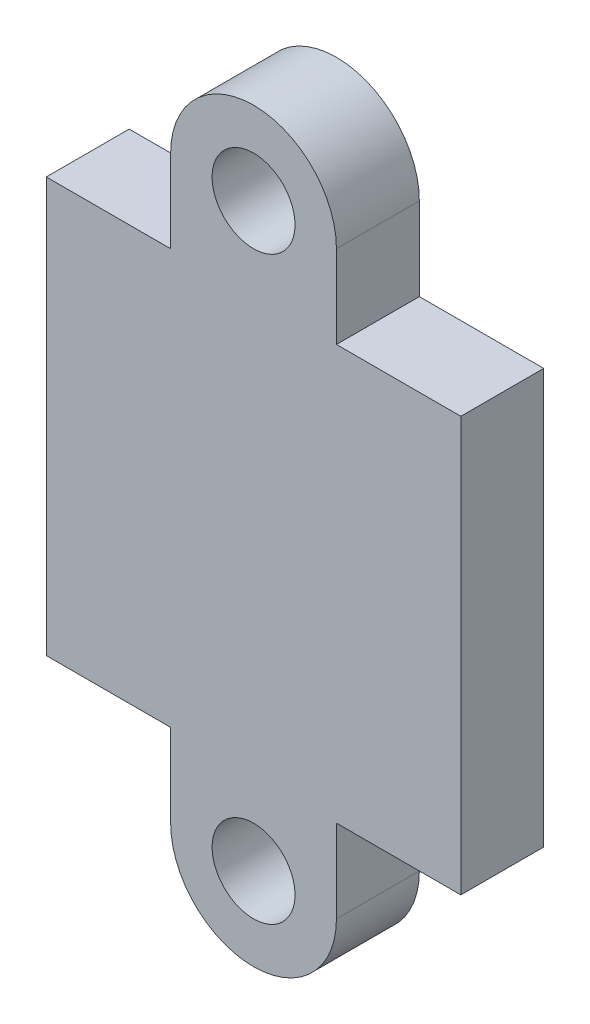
from build123d import *

# Parameters (mm, degrees)
SKETCH1_R      = 10
EXTRUDE1_DEPTH = 10


with BuildPart() as part:
    # Sketch1 → Extrude1 (new, symmetric)
    with BuildSketch(Plane.XY):
        with BuildLine():
            Line((0, -50), (0, 50))
            Line((0, 50), (30, 50))
            Line((30, 50), (30, 70))
            ThreePointArc((30, 70), (50, 90), (70, 70))
            Line((70, 70), (70, 50))
            Line((70, 50), (100, 50))
            Line((100, 50), (100, -50))
            Line((100, -50), (70, -50))
            Line((70, -50), (70, -70))
            ThreePointArc((70, -70), (50, -90), (30, -70))
            Line((30, -70), (30, -50))
            Line((30, -50), (0, -50))
        make_face()
        with Locations((50, 70)):
            Circle(SKETCH1_R, mode=Mode.SUBTRACT)
        with Locations(Location((50, -70, 0), (0, 0, 180))):
            Circle(SKETCH1_R, mode=Mode.SUBTRACT)
    extrude(amount=EXTRUDE1_DEPTH, both=True)


solid = part.part
